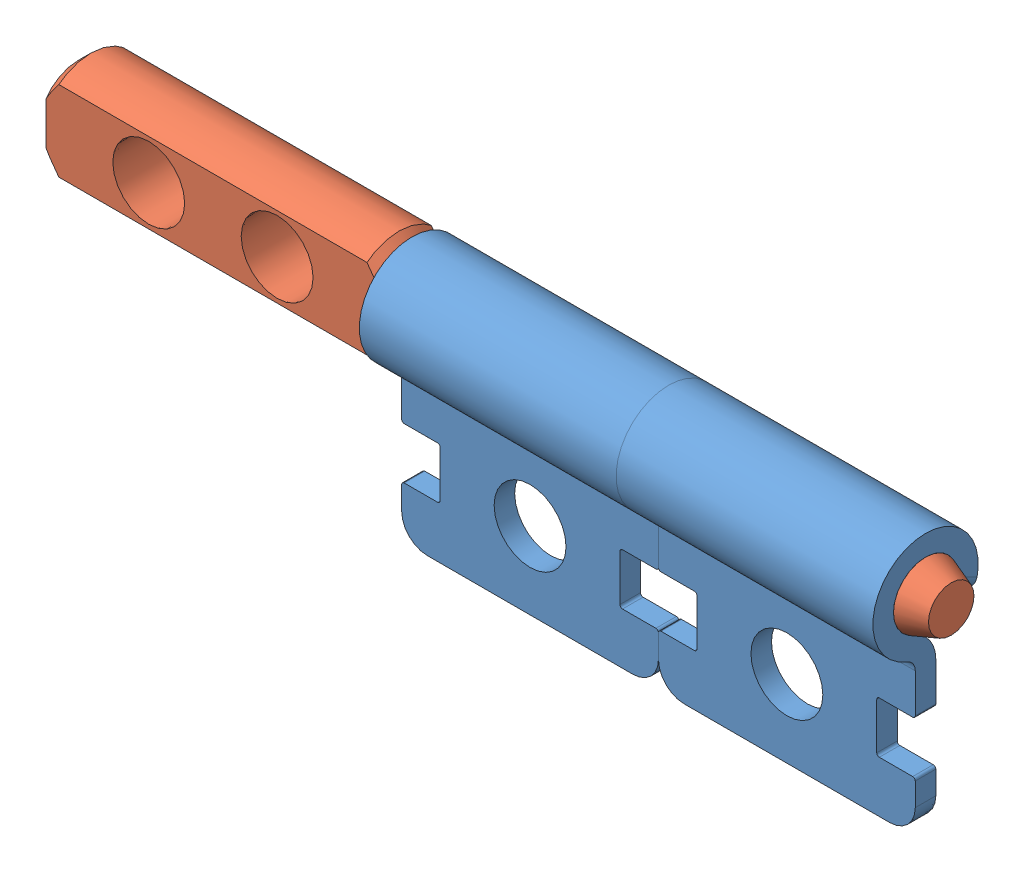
SolidWorks assembly ST060A0.SLDASM, configuration Default (file format 7000). Lengths in mm.
Overall size (34 10.05 4.1).
3 component instances, 2 part files, 6 mates.
Components (placement in the parent):
- ST030A Bracket-1: ST030A Bracket.SLDPRT [Default] at (-8.7526 2.7652 10.0581) size (10.06 10.05 4.1)
- ST030A Bracket-2: ST030A Bracket.SLDPRT [Default] at (1.2474 2.7652 10.0581) size (10.06 10.05 4.1)
- ST060A Shaft-1: ST060A Shaft.SLDPRT [ST080B0] at (-21.7526 2.7652 10.0581) size (34 4 2.5)
Mates (geometry in assembly coordinates):
- Coincident1: coincident anti-aligned: plane of ST030A Bracket-1 through (1.2474 0.3793 10.9581) normal (1 0 0); plane of ST030A Bracket-2 through (1.2474 0.3793 10.9581) normal (-1 0 0)
- Concentric1: concentric aligned: cylinder of ST030A Bracket-1 through (1.2474 2.7652 10.0581) axis (-1 0 0) radius 1.25; cylinder of ST030A Bracket-2 through (11.2474 2.7652 10.0581) axis (-1 0 0) radius 1.25
- Parallel1: parallel aligned: plane of ST030A Bracket-1 through (1.2474 0.3793 10.4581) normal (0 0 1); plane of ST030A Bracket-2 through (11.2474 0.3793 10.4581) normal (0 0 1)
- Coincident3: coincident anti-aligned: plane of ST030A Bracket-1 through (-8.7526 0.3793 10.9581) normal (-1 0 0); plane of ST060A Shaft-1 through (-8.7526 4.2652 10.0581) normal (1 0 0)
- Concentric2: concentric aligned: cylinder of ST030A Bracket-1 through (1.2474 2.7652 10.0581) axis (-1 0 0) radius 1.25; cylinder of ST060A Shaft-1 through (-21.7526 2.7652 10.0581) axis (-1 0 0) radius 1.25
- Parallel2: parallel aligned: plane of ST030A Bracket-1 through (1.2474 0.3793 10.4581) normal (0 0 1); plane of ST060A Shaft-1 through (-2.7526 0.7652 11.3081) normal (0 0 1)
